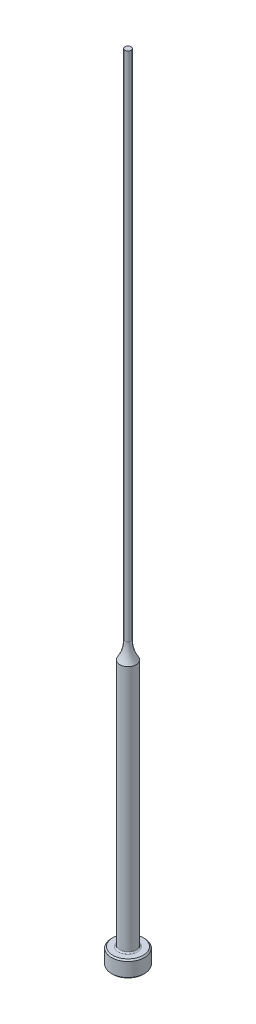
ISO-10303-21;
HEADER;
FILE_DESCRIPTION(('STEP AP214'),'2;1');
FILE_NAME('part.step','',(''),(''),'','','');
FILE_SCHEMA(('AUTOMOTIVE_DESIGN { 1 0 10303 214 1 1 1 1 }'));
ENDSEC;
DATA;
#1=APPLICATION_CONTEXT('core data for automotive mechanical design processes');
#2=APPLICATION_PROTOCOL_DEFINITION('international standard','automotive_design',2000,#1);
#3=PRODUCT_CONTEXT('',#1,'mechanical');
#4=PRODUCT('Part','Part','',(#3));
#5=PRODUCT_RELATED_PRODUCT_CATEGORY('part','',(#4));
#6=PRODUCT_DEFINITION_FORMATION('','',#4);
#7=PRODUCT_DEFINITION_CONTEXT('part definition',#1,'design');
#8=PRODUCT_DEFINITION('design','',#6,#7);
#9=PRODUCT_DEFINITION_SHAPE('','',#8);
#10=(LENGTH_UNIT() NAMED_UNIT(*) SI_UNIT(.MILLI.,.METRE.));
#11=(NAMED_UNIT(*) PLANE_ANGLE_UNIT() SI_UNIT($,.RADIAN.));
#12=(NAMED_UNIT(*) SI_UNIT($,.STERADIAN.) SOLID_ANGLE_UNIT());
#13=UNCERTAINTY_MEASURE_WITH_UNIT(LENGTH_MEASURE(1.E-05),#10,'distance_accuracy_value','');
#14=(GEOMETRIC_REPRESENTATION_CONTEXT(3) GLOBAL_UNCERTAINTY_ASSIGNED_CONTEXT((#13)) GLOBAL_UNIT_ASSIGNED_CONTEXT((#10,
#11,#12)) REPRESENTATION_CONTEXT('',''));
#15=CARTESIAN_POINT('',(0.,0.,0.));
#16=DIRECTION('',(0.,0.,1.));
#17=DIRECTION('',(1.,0.,0.));
#18=AXIS2_PLACEMENT_3D('',#15,#16,#17);
#19=CARTESIAN_POINT('',(-0.594359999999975,152.4,0.));
#20=DIRECTION('',(0.,1.,0.));
#21=DIRECTION('',(0.,0.,1.));
#22=AXIS2_PLACEMENT_3D('',#19,#20,#21);
#23=PLANE('',#22);
#24=CARTESIAN_POINT('',(0.,152.4,0.));
#25=DIRECTION('',(0.,1.,0.));
#26=DIRECTION('',(0.,0.,1.));
#27=AXIS2_PLACEMENT_3D('',#24,#25,#26);
#28=CIRCLE('',#27,0.594359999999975);
#29=CARTESIAN_POINT('',(0.,152.4,0.594359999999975));
#30=VERTEX_POINT('',#29);
#31=EDGE_CURVE('E61',#30,#30,#28,.T.);
#32=ORIENTED_EDGE('',*,*,#31,.T.);
#33=EDGE_LOOP('',(#32));
#34=FACE_BOUND('',#33,.T.);
#35=ADVANCED_FACE('F35',(#34),#23,.T.);
#36=CARTESIAN_POINT('',(0.,259.958771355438,0.));
#37=DIRECTION('',(0.,1.,0.));
#38=DIRECTION('',(0.,0.,1.));
#39=AXIS2_PLACEMENT_3D('',#36,#37,#38);
#40=CYLINDRICAL_SURFACE('',#39,0.594359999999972);
#41=CARTESIAN_POINT('',(0.,54.2097728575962,0.));
#42=DIRECTION('',(0.,1.,0.));
#43=DIRECTION('',(0.,0.,1.));
#44=AXIS2_PLACEMENT_3D('',#41,#42,#43);
#45=CIRCLE('',#44,0.59435999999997);
#46=CARTESIAN_POINT('',(0.,54.2097728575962,0.59435999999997));
#47=VERTEX_POINT('',#46);
#48=EDGE_CURVE('E64',#47,#47,#45,.T.);
#49=ORIENTED_EDGE('',*,*,#48,.T.);
#50=EDGE_LOOP('',(#49));
#51=FACE_BOUND('',#50,.T.);
#52=ORIENTED_EDGE('',*,*,#31,.F.);
#53=EDGE_LOOP('',(#52));
#54=FACE_BOUND('',#53,.T.);
#55=ADVANCED_FACE('F84',(#51,#54),#40,.T.);
#56=CARTESIAN_POINT('',(0.,54.2097728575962,0.));
#57=DIRECTION('',(0.,1.,0.));
#58=DIRECTION('',(0.,0.,1.));
#59=AXIS2_PLACEMENT_3D('',#56,#57,#58);
#60=TOROIDAL_SURFACE('',#59,6.94435999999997,6.35);
#61=CARTESIAN_POINT('',(0.,50.8,0.));
#62=DIRECTION('',(0.,1.,0.));
#63=DIRECTION('',(0.,0.,1.));
#64=AXIS2_PLACEMENT_3D('',#61,#62,#63);
#65=CIRCLE('',#64,1.58749999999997);
#66=CARTESIAN_POINT('',(0.,50.8,1.58749999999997));
#67=VERTEX_POINT('',#66);
#68=EDGE_CURVE('E67',#67,#67,#65,.T.);
#69=ORIENTED_EDGE('',*,*,#68,.T.);
#70=EDGE_LOOP('',(#69));
#71=FACE_BOUND('',#70,.T.);
#72=ORIENTED_EDGE('',*,*,#48,.F.);
#73=EDGE_LOOP('',(#72));
#74=FACE_BOUND('',#73,.T.);
#75=ADVANCED_FACE('F71',(#71,#74),#60,.F.);
#76=CARTESIAN_POINT('',(0.,259.958771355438,0.));
#77=DIRECTION('',(0.,1.,0.));
#78=DIRECTION('',(0.,0.,1.));
#79=AXIS2_PLACEMENT_3D('',#76,#77,#78);
#80=CYLINDRICAL_SURFACE('',#79,1.58749999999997);
#81=CARTESIAN_POINT('',(0.,3.42900000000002,0.));
#82=DIRECTION('',(0.,1.,0.));
#83=DIRECTION('',(0.,0.,1.));
#84=AXIS2_PLACEMENT_3D('',#81,#82,#83);
#85=CIRCLE('',#84,1.58749999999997);
#86=CARTESIAN_POINT('',(0.,3.42900000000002,1.58749999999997));
#87=VERTEX_POINT('',#86);
#88=EDGE_CURVE('E42',#87,#87,#85,.T.);
#89=ORIENTED_EDGE('',*,*,#88,.T.);
#90=EDGE_LOOP('',(#89));
#91=FACE_BOUND('',#90,.T.);
#92=ORIENTED_EDGE('',*,*,#68,.F.);
#93=EDGE_LOOP('',(#92));
#94=FACE_BOUND('',#93,.T.);
#95=ADVANCED_FACE('F74',(#91,#94),#80,.T.);
#96=CARTESIAN_POINT('',(-3.17499999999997,3.175,0.));
#97=DIRECTION('',(0.,1.,0.));
#98=DIRECTION('',(0.,0.,1.));
#99=AXIS2_PLACEMENT_3D('',#96,#97,#98);
#100=PLANE('',#99);
#101=CARTESIAN_POINT('',(0.,3.175,0.));
#102=DIRECTION('',(0.,1.,0.));
#103=DIRECTION('',(0.,0.,1.));
#104=AXIS2_PLACEMENT_3D('',#101,#102,#103);
#105=CIRCLE('',#104,1.84149999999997);
#106=CARTESIAN_POINT('',(0.,3.175,1.84149999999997));
#107=VERTEX_POINT('',#106);
#108=EDGE_CURVE('E10',#107,#107,#105,.F.);
#109=ORIENTED_EDGE('',*,*,#108,.T.);
#110=EDGE_LOOP('',(#109));
#111=FACE_BOUND('',#110,.T.);
#112=CARTESIAN_POINT('',(0.,3.175,0.));
#113=DIRECTION('',(0.,1.,0.));
#114=DIRECTION('',(0.,0.,1.));
#115=AXIS2_PLACEMENT_3D('',#112,#113,#114);
#116=CIRCLE('',#115,2.92099999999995);
#117=CARTESIAN_POINT('',(0.,3.175,2.92099999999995));
#118=VERTEX_POINT('',#117);
#119=EDGE_CURVE('E58',#118,#118,#116,.T.);
#120=ORIENTED_EDGE('',*,*,#119,.T.);
#121=EDGE_LOOP('',(#120));
#122=FACE_BOUND('',#121,.T.);
#123=ADVANCED_FACE('F76',(#111,#122),#100,.T.);
#124=CARTESIAN_POINT('',(0.,259.958771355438,0.));
#125=DIRECTION('',(0.,1.,0.));
#126=DIRECTION('',(0.,0.,1.));
#127=AXIS2_PLACEMENT_3D('',#124,#125,#126);
#128=CYLINDRICAL_SURFACE('',#127,3.17499999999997);
#129=CARTESIAN_POINT('',(0.,2.92100000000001,0.));
#130=DIRECTION('',(0.,1.,0.));
#131=DIRECTION('',(0.,0.,1.));
#132=AXIS2_PLACEMENT_3D('',#129,#130,#131);
#133=CIRCLE('',#132,3.17499999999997);
#134=CARTESIAN_POINT('',(0.,2.92100000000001,3.17499999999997));
#135=VERTEX_POINT('',#134);
#136=EDGE_CURVE('E50',#135,#135,#133,.F.);
#137=ORIENTED_EDGE('',*,*,#136,.T.);
#138=EDGE_LOOP('',(#137));
#139=FACE_BOUND('',#138,.T.);
#140=CARTESIAN_POINT('',(0.,0.254000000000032,0.));
#141=DIRECTION('',(0.,-1.,0.));
#142=DIRECTION('',(0.,0.,-1.));
#143=AXIS2_PLACEMENT_3D('',#140,#141,#142);
#144=CIRCLE('',#143,3.17499999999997);
#145=CARTESIAN_POINT('',(0.,0.254000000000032,-3.17499999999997));
#146=VERTEX_POINT('',#145);
#147=EDGE_CURVE('E55',#146,#146,#144,.F.);
#148=ORIENTED_EDGE('',*,*,#147,.T.);
#149=EDGE_LOOP('',(#148));
#150=FACE_BOUND('',#149,.T.);
#151=ADVANCED_FACE('F82',(#139,#150),#128,.T.);
#152=CARTESIAN_POINT('',(0.,0.,0.));
#153=DIRECTION('',(0.,-1.,0.));
#154=DIRECTION('',(0.,0.,-1.));
#155=AXIS2_PLACEMENT_3D('',#152,#153,#154);
#156=PLANE('',#155);
#157=CARTESIAN_POINT('',(0.,0.,0.));
#158=DIRECTION('',(0.,-1.,0.));
#159=DIRECTION('',(0.,0.,-1.));
#160=AXIS2_PLACEMENT_3D('',#157,#158,#159);
#161=CIRCLE('',#160,2.92099999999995);
#162=CARTESIAN_POINT('',(0.,0.,-2.92099999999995));
#163=VERTEX_POINT('',#162);
#164=EDGE_CURVE('E46',#163,#163,#161,.T.);
#165=ORIENTED_EDGE('',*,*,#164,.T.);
#166=EDGE_LOOP('',(#165));
#167=FACE_BOUND('',#166,.T.);
#168=ADVANCED_FACE('F98',(#167),#156,.T.);
#169=CARTESIAN_POINT('',(0.,3.17499999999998,0.));
#170=DIRECTION('',(0.,-1.,0.));
#171=DIRECTION('',(0.,0.,-1.));
#172=AXIS2_PLACEMENT_3D('',#169,#170,#171);
#173=CONICAL_SURFACE('',#172,2.92099999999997,0.7853981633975);
#174=ORIENTED_EDGE('',*,*,#136,.F.);
#175=EDGE_LOOP('',(#174));
#176=FACE_BOUND('',#175,.T.);
#177=ORIENTED_EDGE('',*,*,#119,.F.);
#178=EDGE_LOOP('',(#177));
#179=FACE_BOUND('',#178,.T.);
#180=ADVANCED_FACE('F95',(#176,#179),#173,.T.);
#181=CARTESIAN_POINT('',(0.,0.254000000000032,0.));
#182=DIRECTION('',(0.,1.,0.));
#183=DIRECTION('',(0.,0.,1.));
#184=AXIS2_PLACEMENT_3D('',#181,#182,#183);
#185=CONICAL_SURFACE('',#184,3.17499999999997,0.785398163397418);
#186=ORIENTED_EDGE('',*,*,#164,.F.);
#187=EDGE_LOOP('',(#186));
#188=FACE_BOUND('',#187,.T.);
#189=ORIENTED_EDGE('',*,*,#147,.F.);
#190=EDGE_LOOP('',(#189));
#191=FACE_BOUND('',#190,.T.);
#192=ADVANCED_FACE('F97',(#188,#191),#185,.T.);
#193=CARTESIAN_POINT('',(0.,3.42900000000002,0.));
#194=DIRECTION('',(0.,1.,0.));
#195=DIRECTION('',(0.,0.,1.));
#196=AXIS2_PLACEMENT_3D('',#193,#194,#195);
#197=TOROIDAL_SURFACE('',#196,1.84149999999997,0.254);
#198=ORIENTED_EDGE('',*,*,#108,.F.);
#199=EDGE_LOOP('',(#198));
#200=FACE_BOUND('',#199,.T.);
#201=ORIENTED_EDGE('',*,*,#88,.F.);
#202=EDGE_LOOP('',(#201));
#203=FACE_BOUND('',#202,.T.);
#204=ADVANCED_FACE('F37',(#200,#203),#197,.F.);
#205=CLOSED_SHELL('',(#35,#55,#75,#95,#123,#151,#168,#180,#192,#204));
#206=MANIFOLD_SOLID_BREP('B2',#205);
#207=ADVANCED_BREP_SHAPE_REPRESENTATION('',(#18,#206),#14);
#208=SHAPE_DEFINITION_REPRESENTATION(#9,#207);
ENDSEC;
END-ISO-10303-21;
